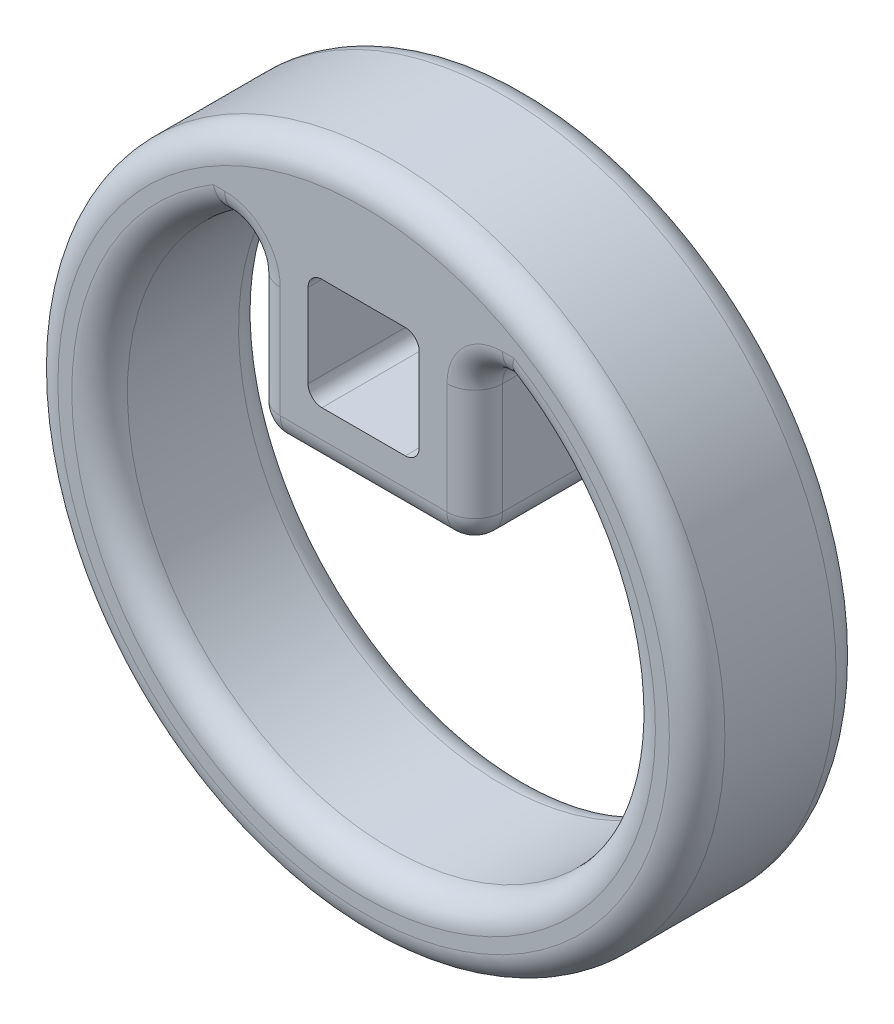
ISO-10303-21;
HEADER;
FILE_DESCRIPTION(('STEP AP214'),'2;1');
FILE_NAME('part.step','',(''),(''),'','','');
FILE_SCHEMA(('AUTOMOTIVE_DESIGN { 1 0 10303 214 1 1 1 1 }'));
ENDSEC;
DATA;
#1=APPLICATION_CONTEXT('core data for automotive mechanical design processes');
#2=APPLICATION_PROTOCOL_DEFINITION('international standard','automotive_design',2000,#1);
#3=PRODUCT_CONTEXT('',#1,'mechanical');
#4=PRODUCT('Part','Part','',(#3));
#5=PRODUCT_RELATED_PRODUCT_CATEGORY('part','',(#4));
#6=PRODUCT_DEFINITION_FORMATION('','',#4);
#7=PRODUCT_DEFINITION_CONTEXT('part definition',#1,'design');
#8=PRODUCT_DEFINITION('design','',#6,#7);
#9=PRODUCT_DEFINITION_SHAPE('','',#8);
#10=(LENGTH_UNIT() NAMED_UNIT(*) SI_UNIT(.MILLI.,.METRE.));
#11=(NAMED_UNIT(*) PLANE_ANGLE_UNIT() SI_UNIT($,.RADIAN.));
#12=(NAMED_UNIT(*) SI_UNIT($,.STERADIAN.) SOLID_ANGLE_UNIT());
#13=UNCERTAINTY_MEASURE_WITH_UNIT(LENGTH_MEASURE(1.E-05),#10,'distance_accuracy_value','');
#14=(GEOMETRIC_REPRESENTATION_CONTEXT(3) GLOBAL_UNCERTAINTY_ASSIGNED_CONTEXT((#13)) GLOBAL_UNIT_ASSIGNED_CONTEXT((#10,
#11,#12)) REPRESENTATION_CONTEXT('',''));
#15=CARTESIAN_POINT('',(0.,0.,0.));
#16=DIRECTION('',(0.,0.,1.));
#17=DIRECTION('',(1.,0.,0.));
#18=AXIS2_PLACEMENT_3D('',#15,#16,#17);
#19=CARTESIAN_POINT('',(0.336140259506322,-12.7325926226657,12.));
#20=DIRECTION('',(0.,0.,1.));
#21=DIRECTION('',(1.,0.,0.));
#22=AXIS2_PLACEMENT_3D('',#19,#20,#21);
#23=PLANE('',#22);
#24=CARTESIAN_POINT('',(0.336140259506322,-12.7325926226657,12.));
#25=DIRECTION('',(0.,0.,1.));
#26=DIRECTION('',(1.,0.,0.));
#27=AXIS2_PLACEMENT_3D('',#24,#25,#26);
#28=CIRCLE('',#27,22.);
#29=CARTESIAN_POINT('',(22.3361402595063,-12.7325926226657,12.));
#30=VERTEX_POINT('',#29);
#31=EDGE_CURVE('E328',#30,#30,#28,.T.);
#32=ORIENTED_EDGE('',*,*,#31,.T.);
#33=EDGE_LOOP('',(#32));
#34=FACE_BOUND('',#33,.T.);
#35=DIRECTION('',(1.,0.,0.));
#36=VECTOR('',#35,1.);
#37=CARTESIAN_POINT('',(-2.66385974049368,-4.73259262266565,12.));
#38=LINE('',#37,#36);
#39=CARTESIAN_POINT('',(-2.66385974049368,-4.73259262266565,12.));
#40=VERTEX_POINT('',#39);
#41=CARTESIAN_POINT('',(3.33614025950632,-4.73259262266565,12.));
#42=VERTEX_POINT('',#41);
#43=EDGE_CURVE('E229',#40,#42,#38,.T.);
#44=ORIENTED_EDGE('',*,*,#43,.F.);
#45=CARTESIAN_POINT('',(-2.66385974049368,-3.73259262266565,12.));
#46=DIRECTION('',(0.,0.,1.));
#47=DIRECTION('',(1.,0.,0.));
#48=AXIS2_PLACEMENT_3D('',#45,#46,#47);
#49=CIRCLE('',#48,1.);
#50=CARTESIAN_POINT('',(-3.66385974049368,-3.73259262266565,12.));
#51=VERTEX_POINT('',#50);
#52=EDGE_CURVE('E218',#51,#40,#49,.T.);
#53=ORIENTED_EDGE('',*,*,#52,.F.);
#54=DIRECTION('',(0.,-1.,0.));
#55=VECTOR('',#54,1.);
#56=CARTESIAN_POINT('',(-3.66385974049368,2.26740737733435,12.));
#57=LINE('',#56,#55);
#58=CARTESIAN_POINT('',(-3.66385974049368,2.26740737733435,12.));
#59=VERTEX_POINT('',#58);
#60=EDGE_CURVE('E264',#59,#51,#57,.T.);
#61=ORIENTED_EDGE('',*,*,#60,.F.);
#62=CARTESIAN_POINT('',(-2.66385974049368,2.26740737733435,12.));
#63=DIRECTION('',(0.,0.,1.));
#64=DIRECTION('',(1.,0.,0.));
#65=AXIS2_PLACEMENT_3D('',#62,#63,#64);
#66=CIRCLE('',#65,1.);
#67=CARTESIAN_POINT('',(-2.66385974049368,3.26740737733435,12.));
#68=VERTEX_POINT('',#67);
#69=EDGE_CURVE('E260',#68,#59,#66,.T.);
#70=ORIENTED_EDGE('',*,*,#69,.F.);
#71=DIRECTION('',(-1.,0.,0.));
#72=VECTOR('',#71,1.);
#73=CARTESIAN_POINT('',(-2.66385974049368,3.26740737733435,12.));
#74=LINE('',#73,#72);
#75=CARTESIAN_POINT('',(3.33614025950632,3.26740737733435,12.));
#76=VERTEX_POINT('',#75);
#77=EDGE_CURVE('E257',#76,#68,#74,.T.);
#78=ORIENTED_EDGE('',*,*,#77,.F.);
#79=CARTESIAN_POINT('',(3.33614025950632,2.26740737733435,12.));
#80=DIRECTION('',(0.,0.,1.));
#81=DIRECTION('',(-1.,0.,0.));
#82=AXIS2_PLACEMENT_3D('',#79,#80,#81);
#83=CIRCLE('',#82,1.);
#84=CARTESIAN_POINT('',(4.33614025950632,2.26740737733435,12.));
#85=VERTEX_POINT('',#84);
#86=EDGE_CURVE('E254',#85,#76,#83,.T.);
#87=ORIENTED_EDGE('',*,*,#86,.F.);
#88=DIRECTION('',(0.,1.,0.));
#89=VECTOR('',#88,1.);
#90=CARTESIAN_POINT('',(4.33614025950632,2.26740737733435,12.));
#91=LINE('',#90,#89);
#92=CARTESIAN_POINT('',(4.33614025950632,-3.73259262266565,12.));
#93=VERTEX_POINT('',#92);
#94=EDGE_CURVE('E248',#93,#85,#91,.T.);
#95=ORIENTED_EDGE('',*,*,#94,.F.);
#96=CARTESIAN_POINT('',(3.33614025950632,-3.73259262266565,12.));
#97=DIRECTION('',(0.,0.,1.));
#98=DIRECTION('',(1.,0.,0.));
#99=AXIS2_PLACEMENT_3D('',#96,#97,#98);
#100=CIRCLE('',#99,1.);
#101=EDGE_CURVE('E244',#42,#93,#100,.T.);
#102=ORIENTED_EDGE('',*,*,#101,.F.);
#103=EDGE_LOOP('',(#44,#53,#61,#70,#78,#87,#95,#102));
#104=FACE_BOUND('',#103,.T.);
#105=DIRECTION('',(-1.,0.,0.));
#106=VECTOR('',#105,1.);
#107=CARTESIAN_POINT('',(0.336140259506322,5.26740737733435,12.));
#108=LINE('',#107,#106);
#109=CARTESIAN_POINT('',(10.3361402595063,5.26740737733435,12.));
#110=VERTEX_POINT('',#109);
#111=CARTESIAN_POINT('',(11.1527940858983,5.26740737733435,12.));
#112=VERTEX_POINT('',#111);
#113=EDGE_CURVE('E368',#110,#112,#108,.F.);
#114=ORIENTED_EDGE('',*,*,#113,.T.);
#115=CARTESIAN_POINT('',(0.336140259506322,-12.7325926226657,12.));
#116=DIRECTION('',(0.,0.,1.));
#117=DIRECTION('',(1.,0.,0.));
#118=AXIS2_PLACEMENT_3D('',#115,#116,#117);
#119=CIRCLE('',#118,21.);
#120=CARTESIAN_POINT('',(-10.4805135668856,5.26740737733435,12.));
#121=VERTEX_POINT('',#120);
#122=EDGE_CURVE('E332',#112,#121,#119,.F.);
#123=ORIENTED_EDGE('',*,*,#122,.T.);
#124=DIRECTION('',(-1.,0.,0.));
#125=VECTOR('',#124,1.);
#126=CARTESIAN_POINT('',(0.336140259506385,5.26740737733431,12.));
#127=LINE('',#126,#125);
#128=CARTESIAN_POINT('',(-9.66385974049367,5.26740737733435,12.));
#129=VERTEX_POINT('',#128);
#130=EDGE_CURVE('E359',#121,#129,#127,.F.);
#131=ORIENTED_EDGE('',*,*,#130,.T.);
#132=CARTESIAN_POINT('',(-9.66385974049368,1.26740737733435,12.));
#133=DIRECTION('',(0.,0.,1.));
#134=DIRECTION('',(1.,0.,0.));
#135=AXIS2_PLACEMENT_3D('',#132,#133,#134);
#136=CIRCLE('',#135,4.);
#137=CARTESIAN_POINT('',(-5.66385974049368,1.26740737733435,12.));
#138=VERTEX_POINT('',#137);
#139=EDGE_CURVE('E356',#129,#138,#136,.F.);
#140=ORIENTED_EDGE('',*,*,#139,.T.);
#141=DIRECTION('',(0.,1.,0.));
#142=VECTOR('',#141,1.);
#143=CARTESIAN_POINT('',(-5.66385974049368,-12.7325926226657,12.));
#144=LINE('',#143,#142);
#145=CARTESIAN_POINT('',(-5.66385974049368,-6.73259262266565,12.));
#146=VERTEX_POINT('',#145);
#147=EDGE_CURVE('E353',#138,#146,#144,.F.);
#148=ORIENTED_EDGE('',*,*,#147,.T.);
#149=DIRECTION('',(-1.,0.,0.));
#150=VECTOR('',#149,1.);
#151=CARTESIAN_POINT('',(0.336140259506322,-6.73259262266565,12.));
#152=LINE('',#151,#150);
#153=CARTESIAN_POINT('',(6.33614025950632,-6.73259262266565,12.));
#154=VERTEX_POINT('',#153);
#155=EDGE_CURVE('E350',#146,#154,#152,.F.);
#156=ORIENTED_EDGE('',*,*,#155,.T.);
#157=DIRECTION('',(0.,-1.,0.));
#158=VECTOR('',#157,1.);
#159=CARTESIAN_POINT('',(6.33614025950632,-12.7325926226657,12.));
#160=LINE('',#159,#158);
#161=CARTESIAN_POINT('',(6.33614025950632,1.26740737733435,12.));
#162=VERTEX_POINT('',#161);
#163=EDGE_CURVE('E362',#154,#162,#160,.F.);
#164=ORIENTED_EDGE('',*,*,#163,.T.);
#165=CARTESIAN_POINT('',(10.3361402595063,1.26740737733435,12.));
#166=DIRECTION('',(0.,0.,1.));
#167=DIRECTION('',(1.,0.,0.));
#168=AXIS2_PLACEMENT_3D('',#165,#166,#167);
#169=CIRCLE('',#168,4.);
#170=EDGE_CURVE('E365',#162,#110,#169,.F.);
#171=ORIENTED_EDGE('',*,*,#170,.T.);
#172=EDGE_LOOP('',(#114,#123,#131,#140,#148,#156,#164,#171));
#173=FACE_BOUND('',#172,.T.);
#174=ADVANCED_FACE('F41',(#34,#104,#173),#23,.T.);
#175=CARTESIAN_POINT('',(0.336140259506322,-12.7325926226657,0.));
#176=DIRECTION('',(0.,0.,1.));
#177=DIRECTION('',(1.,0.,0.));
#178=AXIS2_PLACEMENT_3D('',#175,#176,#177);
#179=PLANE('',#178);
#180=CARTESIAN_POINT('',(0.336140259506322,-12.7325926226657,0.));
#181=DIRECTION('',(0.,0.,1.));
#182=DIRECTION('',(1.,0.,0.));
#183=AXIS2_PLACEMENT_3D('',#180,#181,#182);
#184=CIRCLE('',#183,21.);
#185=CARTESIAN_POINT('',(-10.4805135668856,5.26740737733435,0.));
#186=VERTEX_POINT('',#185);
#187=CARTESIAN_POINT('',(11.1527940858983,5.26740737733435,0.));
#188=VERTEX_POINT('',#187);
#189=EDGE_CURVE('E60',#186,#188,#184,.T.);
#190=ORIENTED_EDGE('',*,*,#189,.T.);
#191=DIRECTION('',(-1.,0.,0.));
#192=VECTOR('',#191,1.);
#193=CARTESIAN_POINT('',(10.3361402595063,5.26740737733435,0.));
#194=LINE('',#193,#192);
#195=CARTESIAN_POINT('',(10.3361402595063,5.26740737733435,0.));
#196=VERTEX_POINT('',#195);
#197=EDGE_CURVE('E64',#188,#196,#194,.T.);
#198=ORIENTED_EDGE('',*,*,#197,.T.);
#199=CARTESIAN_POINT('',(10.3361402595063,1.26740737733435,0.));
#200=DIRECTION('',(0.,0.,1.));
#201=DIRECTION('',(1.,0.,0.));
#202=AXIS2_PLACEMENT_3D('',#199,#200,#201);
#203=CIRCLE('',#202,4.);
#204=CARTESIAN_POINT('',(6.33614025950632,1.26740737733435,0.));
#205=VERTEX_POINT('',#204);
#206=EDGE_CURVE('E429',#196,#205,#203,.T.);
#207=ORIENTED_EDGE('',*,*,#206,.T.);
#208=DIRECTION('',(0.,-1.,0.));
#209=VECTOR('',#208,1.);
#210=CARTESIAN_POINT('',(6.33614025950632,-6.73259262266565,0.));
#211=LINE('',#210,#209);
#212=CARTESIAN_POINT('',(6.33614025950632,-6.73259262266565,0.));
#213=VERTEX_POINT('',#212);
#214=EDGE_CURVE('E417',#205,#213,#211,.T.);
#215=ORIENTED_EDGE('',*,*,#214,.T.);
#216=DIRECTION('',(-1.,0.,0.));
#217=VECTOR('',#216,1.);
#218=CARTESIAN_POINT('',(-5.66385974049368,-6.73259262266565,0.));
#219=LINE('',#218,#217);
#220=CARTESIAN_POINT('',(-5.66385974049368,-6.73259262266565,0.));
#221=VERTEX_POINT('',#220);
#222=EDGE_CURVE('E414',#213,#221,#219,.T.);
#223=ORIENTED_EDGE('',*,*,#222,.T.);
#224=DIRECTION('',(0.,1.,0.));
#225=VECTOR('',#224,1.);
#226=CARTESIAN_POINT('',(-5.66385974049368,1.26740737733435,0.));
#227=LINE('',#226,#225);
#228=CARTESIAN_POINT('',(-5.66385974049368,1.26740737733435,0.));
#229=VERTEX_POINT('',#228);
#230=EDGE_CURVE('E420',#221,#229,#227,.T.);
#231=ORIENTED_EDGE('',*,*,#230,.T.);
#232=CARTESIAN_POINT('',(-9.66385974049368,1.26740737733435,0.));
#233=DIRECTION('',(0.,0.,1.));
#234=DIRECTION('',(1.,0.,0.));
#235=AXIS2_PLACEMENT_3D('',#232,#233,#234);
#236=CIRCLE('',#235,4.);
#237=CARTESIAN_POINT('',(-9.66385974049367,5.26740737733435,0.));
#238=VERTEX_POINT('',#237);
#239=EDGE_CURVE('E423',#229,#238,#236,.T.);
#240=ORIENTED_EDGE('',*,*,#239,.T.);
#241=DIRECTION('',(-1.,0.,0.));
#242=VECTOR('',#241,1.);
#243=CARTESIAN_POINT('',(-13.2653302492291,5.26740737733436,0.));
#244=LINE('',#243,#242);
#245=EDGE_CURVE('E426',#238,#186,#244,.T.);
#246=ORIENTED_EDGE('',*,*,#245,.T.);
#247=EDGE_LOOP('',(#190,#198,#207,#215,#223,#231,#240,#246));
#248=FACE_BOUND('',#247,.T.);
#249=CARTESIAN_POINT('',(0.336140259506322,-12.7325926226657,0.));
#250=DIRECTION('',(0.,0.,1.));
#251=DIRECTION('',(1.,0.,0.));
#252=AXIS2_PLACEMENT_3D('',#249,#250,#251);
#253=CIRCLE('',#252,22.);
#254=CARTESIAN_POINT('',(22.3361402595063,-12.7325926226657,0.));
#255=VERTEX_POINT('',#254);
#256=EDGE_CURVE('E238',#255,#255,#253,.F.);
#257=ORIENTED_EDGE('',*,*,#256,.T.);
#258=EDGE_LOOP('',(#257));
#259=FACE_BOUND('',#258,.T.);
#260=CARTESIAN_POINT('',(-2.66385974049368,-3.73259262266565,0.));
#261=DIRECTION('',(0.,0.,1.));
#262=DIRECTION('',(1.,0.,0.));
#263=AXIS2_PLACEMENT_3D('',#260,#261,#262);
#264=CIRCLE('',#263,1.);
#265=CARTESIAN_POINT('',(-3.66385974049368,-3.73259262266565,0.));
#266=VERTEX_POINT('',#265);
#267=CARTESIAN_POINT('',(-2.66385974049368,-4.73259262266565,0.));
#268=VERTEX_POINT('',#267);
#269=EDGE_CURVE('E267',#266,#268,#264,.T.);
#270=ORIENTED_EDGE('',*,*,#269,.T.);
#271=DIRECTION('',(1.,0.,0.));
#272=VECTOR('',#271,1.);
#273=CARTESIAN_POINT('',(-2.66385974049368,-4.73259262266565,0.));
#274=LINE('',#273,#272);
#275=CARTESIAN_POINT('',(3.33614025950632,-4.73259262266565,0.));
#276=VERTEX_POINT('',#275);
#277=EDGE_CURVE('E236',#268,#276,#274,.T.);
#278=ORIENTED_EDGE('',*,*,#277,.T.);
#279=CARTESIAN_POINT('',(3.33614025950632,-3.73259262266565,0.));
#280=DIRECTION('',(0.,0.,1.));
#281=DIRECTION('',(1.,0.,0.));
#282=AXIS2_PLACEMENT_3D('',#279,#280,#281);
#283=CIRCLE('',#282,1.);
#284=CARTESIAN_POINT('',(4.33614025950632,-3.73259262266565,0.));
#285=VERTEX_POINT('',#284);
#286=EDGE_CURVE('E273',#276,#285,#283,.T.);
#287=ORIENTED_EDGE('',*,*,#286,.T.);
#288=DIRECTION('',(0.,1.,0.));
#289=VECTOR('',#288,1.);
#290=CARTESIAN_POINT('',(4.33614025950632,2.26740737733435,0.));
#291=LINE('',#290,#289);
#292=CARTESIAN_POINT('',(4.33614025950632,2.26740737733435,0.));
#293=VERTEX_POINT('',#292);
#294=EDGE_CURVE('E277',#285,#293,#291,.T.);
#295=ORIENTED_EDGE('',*,*,#294,.T.);
#296=CARTESIAN_POINT('',(3.33614025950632,2.26740737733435,0.));
#297=DIRECTION('',(0.,0.,1.));
#298=DIRECTION('',(-1.,0.,0.));
#299=AXIS2_PLACEMENT_3D('',#296,#297,#298);
#300=CIRCLE('',#299,1.);
#301=CARTESIAN_POINT('',(3.33614025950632,3.26740737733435,0.));
#302=VERTEX_POINT('',#301);
#303=EDGE_CURVE('E281',#293,#302,#300,.T.);
#304=ORIENTED_EDGE('',*,*,#303,.T.);
#305=DIRECTION('',(-1.,0.,0.));
#306=VECTOR('',#305,1.);
#307=CARTESIAN_POINT('',(-2.66385974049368,3.26740737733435,0.));
#308=LINE('',#307,#306);
#309=CARTESIAN_POINT('',(-2.66385974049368,3.26740737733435,0.));
#310=VERTEX_POINT('',#309);
#311=EDGE_CURVE('E285',#302,#310,#308,.T.);
#312=ORIENTED_EDGE('',*,*,#311,.T.);
#313=CARTESIAN_POINT('',(-2.66385974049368,2.26740737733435,0.));
#314=DIRECTION('',(0.,0.,1.));
#315=DIRECTION('',(1.,0.,0.));
#316=AXIS2_PLACEMENT_3D('',#313,#314,#315);
#317=CIRCLE('',#316,1.);
#318=CARTESIAN_POINT('',(-3.66385974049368,2.26740737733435,0.));
#319=VERTEX_POINT('',#318);
#320=EDGE_CURVE('E289',#310,#319,#317,.T.);
#321=ORIENTED_EDGE('',*,*,#320,.T.);
#322=DIRECTION('',(0.,-1.,0.));
#323=VECTOR('',#322,1.);
#324=CARTESIAN_POINT('',(-3.66385974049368,2.26740737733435,0.));
#325=LINE('',#324,#323);
#326=EDGE_CURVE('E230',#319,#266,#325,.T.);
#327=ORIENTED_EDGE('',*,*,#326,.T.);
#328=EDGE_LOOP('',(#270,#278,#287,#295,#304,#312,#321,#327));
#329=FACE_BOUND('',#328,.T.);
#330=ADVANCED_FACE('F535',(#248,#259,#329),#179,.F.);
#331=CARTESIAN_POINT('',(0.336140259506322,-12.7325926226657,12.));
#332=DIRECTION('',(0.,0.,-1.));
#333=DIRECTION('',(-1.,0.,0.));
#334=AXIS2_PLACEMENT_3D('',#331,#332,#333);
#335=CYLINDRICAL_SURFACE('',#334,24.);
#336=CARTESIAN_POINT('',(0.336140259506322,-12.7325926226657,10.));
#337=DIRECTION('',(0.,0.,1.));
#338=DIRECTION('',(1.,0.,0.));
#339=AXIS2_PLACEMENT_3D('',#336,#337,#338);
#340=CIRCLE('',#339,24.);
#341=CARTESIAN_POINT('',(24.3361402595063,-12.7325926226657,10.));
#342=VERTEX_POINT('',#341);
#343=EDGE_CURVE('E339',#342,#342,#340,.F.);
#344=ORIENTED_EDGE('',*,*,#343,.T.);
#345=EDGE_LOOP('',(#344));
#346=FACE_BOUND('',#345,.T.);
#347=CARTESIAN_POINT('',(0.336140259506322,-12.7325926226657,2.));
#348=DIRECTION('',(0.,0.,1.));
#349=DIRECTION('',(1.,0.,0.));
#350=AXIS2_PLACEMENT_3D('',#347,#348,#349);
#351=CIRCLE('',#350,24.);
#352=CARTESIAN_POINT('',(24.3361402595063,-12.7325926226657,2.));
#353=VERTEX_POINT('',#352);
#354=EDGE_CURVE('E335',#353,#353,#351,.T.);
#355=ORIENTED_EDGE('',*,*,#354,.T.);
#356=EDGE_LOOP('',(#355));
#357=FACE_BOUND('',#356,.T.);
#358=ADVANCED_FACE('F531',(#346,#357),#335,.T.);
#359=CARTESIAN_POINT('',(-2.66385974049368,-3.73259262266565,12.));
#360=DIRECTION('',(0.,0.,-1.));
#361=DIRECTION('',(-1.,0.,0.));
#362=AXIS2_PLACEMENT_3D('',#359,#360,#361);
#363=CYLINDRICAL_SURFACE('',#362,1.);
#364=ORIENTED_EDGE('',*,*,#269,.F.);
#365=DIRECTION('',(0.,0.,-1.));
#366=VECTOR('',#365,1.);
#367=CARTESIAN_POINT('',(-3.66385974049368,-3.73259262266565,12.));
#368=LINE('',#367,#366);
#369=EDGE_CURVE('E224',#51,#266,#368,.T.);
#370=ORIENTED_EDGE('',*,*,#369,.F.);
#371=ORIENTED_EDGE('',*,*,#52,.T.);
#372=DIRECTION('',(0.,0.,-1.));
#373=VECTOR('',#372,1.);
#374=CARTESIAN_POINT('',(-2.66385974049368,-4.73259262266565,12.));
#375=LINE('',#374,#373);
#376=EDGE_CURVE('E221',#40,#268,#375,.T.);
#377=ORIENTED_EDGE('',*,*,#376,.T.);
#378=EDGE_LOOP('',(#364,#370,#371,#377));
#379=FACE_BOUND('',#378,.T.);
#380=ADVANCED_FACE('F220',(#379),#363,.F.);
#381=CARTESIAN_POINT('',(-2.66385974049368,-4.73259262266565,12.));
#382=DIRECTION('',(0.,1.,0.));
#383=DIRECTION('',(-1.,0.,0.));
#384=AXIS2_PLACEMENT_3D('',#381,#382,#383);
#385=PLANE('',#384);
#386=ORIENTED_EDGE('',*,*,#277,.F.);
#387=ORIENTED_EDGE('',*,*,#376,.F.);
#388=ORIENTED_EDGE('',*,*,#43,.T.);
#389=DIRECTION('',(0.,0.,-1.));
#390=VECTOR('',#389,1.);
#391=CARTESIAN_POINT('',(3.33614025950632,-4.73259262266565,12.));
#392=LINE('',#391,#390);
#393=EDGE_CURVE('E239',#42,#276,#392,.T.);
#394=ORIENTED_EDGE('',*,*,#393,.T.);
#395=EDGE_LOOP('',(#386,#387,#388,#394));
#396=FACE_BOUND('',#395,.T.);
#397=ADVANCED_FACE('F233',(#396),#385,.T.);
#398=CARTESIAN_POINT('',(3.33614025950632,-3.73259262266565,12.));
#399=DIRECTION('',(0.,0.,-1.));
#400=DIRECTION('',(-1.,0.,0.));
#401=AXIS2_PLACEMENT_3D('',#398,#399,#400);
#402=CYLINDRICAL_SURFACE('',#401,1.);
#403=ORIENTED_EDGE('',*,*,#286,.F.);
#404=ORIENTED_EDGE('',*,*,#393,.F.);
#405=ORIENTED_EDGE('',*,*,#101,.T.);
#406=DIRECTION('',(0.,0.,-1.));
#407=VECTOR('',#406,1.);
#408=CARTESIAN_POINT('',(4.33614025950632,-3.73259262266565,12.));
#409=LINE('',#408,#407);
#410=EDGE_CURVE('E310',#93,#285,#409,.T.);
#411=ORIENTED_EDGE('',*,*,#410,.T.);
#412=EDGE_LOOP('',(#403,#404,#405,#411));
#413=FACE_BOUND('',#412,.T.);
#414=ADVANCED_FACE('F546',(#413),#402,.F.);
#415=CARTESIAN_POINT('',(4.33614025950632,2.26740737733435,12.));
#416=DIRECTION('',(-1.,0.,0.));
#417=DIRECTION('',(0.,0.,1.));
#418=AXIS2_PLACEMENT_3D('',#415,#416,#417);
#419=PLANE('',#418);
#420=ORIENTED_EDGE('',*,*,#294,.F.);
#421=ORIENTED_EDGE('',*,*,#410,.F.);
#422=ORIENTED_EDGE('',*,*,#94,.T.);
#423=DIRECTION('',(0.,0.,-1.));
#424=VECTOR('',#423,1.);
#425=CARTESIAN_POINT('',(4.33614025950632,2.26740737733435,12.));
#426=LINE('',#425,#424);
#427=EDGE_CURVE('E307',#85,#293,#426,.T.);
#428=ORIENTED_EDGE('',*,*,#427,.T.);
#429=EDGE_LOOP('',(#420,#421,#422,#428));
#430=FACE_BOUND('',#429,.T.);
#431=ADVANCED_FACE('F549',(#430),#419,.T.);
#432=CARTESIAN_POINT('',(3.33614025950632,2.26740737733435,12.));
#433=DIRECTION('',(0.,0.,-1.));
#434=DIRECTION('',(-1.,0.,0.));
#435=AXIS2_PLACEMENT_3D('',#432,#433,#434);
#436=CYLINDRICAL_SURFACE('',#435,1.);
#437=ORIENTED_EDGE('',*,*,#303,.F.);
#438=ORIENTED_EDGE('',*,*,#427,.F.);
#439=ORIENTED_EDGE('',*,*,#86,.T.);
#440=DIRECTION('',(0.,0.,-1.));
#441=VECTOR('',#440,1.);
#442=CARTESIAN_POINT('',(3.33614025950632,3.26740737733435,12.));
#443=LINE('',#442,#441);
#444=EDGE_CURVE('E304',#76,#302,#443,.T.);
#445=ORIENTED_EDGE('',*,*,#444,.T.);
#446=EDGE_LOOP('',(#437,#438,#439,#445));
#447=FACE_BOUND('',#446,.T.);
#448=ADVANCED_FACE('F553',(#447),#436,.F.);
#449=CARTESIAN_POINT('',(-2.66385974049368,3.26740737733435,12.));
#450=DIRECTION('',(0.,-1.,0.));
#451=DIRECTION('',(1.,0.,0.));
#452=AXIS2_PLACEMENT_3D('',#449,#450,#451);
#453=PLANE('',#452);
#454=ORIENTED_EDGE('',*,*,#311,.F.);
#455=ORIENTED_EDGE('',*,*,#444,.F.);
#456=ORIENTED_EDGE('',*,*,#77,.T.);
#457=DIRECTION('',(0.,0.,-1.));
#458=VECTOR('',#457,1.);
#459=CARTESIAN_POINT('',(-2.66385974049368,3.26740737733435,12.));
#460=LINE('',#459,#458);
#461=EDGE_CURVE('E301',#68,#310,#460,.T.);
#462=ORIENTED_EDGE('',*,*,#461,.T.);
#463=EDGE_LOOP('',(#454,#455,#456,#462));
#464=FACE_BOUND('',#463,.T.);
#465=ADVANCED_FACE('F557',(#464),#453,.T.);
#466=CARTESIAN_POINT('',(-2.66385974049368,2.26740737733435,12.));
#467=DIRECTION('',(0.,0.,-1.));
#468=DIRECTION('',(-1.,0.,0.));
#469=AXIS2_PLACEMENT_3D('',#466,#467,#468);
#470=CYLINDRICAL_SURFACE('',#469,1.);
#471=ORIENTED_EDGE('',*,*,#320,.F.);
#472=ORIENTED_EDGE('',*,*,#461,.F.);
#473=ORIENTED_EDGE('',*,*,#69,.T.);
#474=DIRECTION('',(0.,0.,-1.));
#475=VECTOR('',#474,1.);
#476=CARTESIAN_POINT('',(-3.66385974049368,2.26740737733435,12.));
#477=LINE('',#476,#475);
#478=EDGE_CURVE('E298',#59,#319,#477,.T.);
#479=ORIENTED_EDGE('',*,*,#478,.T.);
#480=EDGE_LOOP('',(#471,#472,#473,#479));
#481=FACE_BOUND('',#480,.T.);
#482=ADVANCED_FACE('F561',(#481),#470,.F.);
#483=CARTESIAN_POINT('',(-3.66385974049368,2.26740737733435,12.));
#484=DIRECTION('',(1.,0.,0.));
#485=DIRECTION('',(0.,1.,0.));
#486=AXIS2_PLACEMENT_3D('',#483,#484,#485);
#487=PLANE('',#486);
#488=ORIENTED_EDGE('',*,*,#326,.F.);
#489=ORIENTED_EDGE('',*,*,#478,.F.);
#490=ORIENTED_EDGE('',*,*,#60,.T.);
#491=ORIENTED_EDGE('',*,*,#369,.T.);
#492=EDGE_LOOP('',(#488,#489,#490,#491));
#493=FACE_BOUND('',#492,.T.);
#494=ADVANCED_FACE('F565',(#493),#487,.T.);
#495=CARTESIAN_POINT('',(6.33614025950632,-6.73259262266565,12.));
#496=DIRECTION('',(0.,0.,-1.));
#497=DIRECTION('',(-1.,0.,0.));
#498=AXIS2_PLACEMENT_3D('',#495,#496,#497);
#499=CYLINDRICAL_SURFACE('',#498,2.);
#500=DIRECTION('',(0.,0.,-1.));
#501=VECTOR('',#500,1.);
#502=CARTESIAN_POINT('',(8.33614025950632,-6.73259262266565,12.));
#503=LINE('',#502,#501);
#504=CARTESIAN_POINT('',(8.33614025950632,-6.73259262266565,10.));
#505=VERTEX_POINT('',#504);
#506=CARTESIAN_POINT('',(8.33614025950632,-6.73259262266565,2.));
#507=VERTEX_POINT('',#506);
#508=EDGE_CURVE('E620',#505,#507,#503,.T.);
#509=ORIENTED_EDGE('',*,*,#508,.F.);
#510=CARTESIAN_POINT('',(6.33614025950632,-6.73259262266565,10.));
#511=DIRECTION('',(0.,0.,-1.));
#512=DIRECTION('',(-1.,0.,0.));
#513=AXIS2_PLACEMENT_3D('',#510,#511,#512);
#514=CIRCLE('',#513,2.);
#515=CARTESIAN_POINT('',(6.33614025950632,-8.73259262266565,10.));
#516=VERTEX_POINT('',#515);
#517=EDGE_CURVE('E387',#505,#516,#514,.T.);
#518=ORIENTED_EDGE('',*,*,#517,.T.);
#519=DIRECTION('',(0.,0.,-1.));
#520=VECTOR('',#519,1.);
#521=CARTESIAN_POINT('',(6.33614025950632,-8.73259262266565,12.));
#522=LINE('',#521,#520);
#523=CARTESIAN_POINT('',(6.33614025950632,-8.73259262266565,2.));
#524=VERTEX_POINT('',#523);
#525=EDGE_CURVE('E270',#516,#524,#522,.T.);
#526=ORIENTED_EDGE('',*,*,#525,.T.);
#527=CARTESIAN_POINT('',(6.33614025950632,-6.73259262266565,2.));
#528=DIRECTION('',(0.,0.,-1.));
#529=DIRECTION('',(-1.,0.,0.));
#530=AXIS2_PLACEMENT_3D('',#527,#528,#529);
#531=CIRCLE('',#530,2.);
#532=EDGE_CURVE('E384',#524,#507,#531,.F.);
#533=ORIENTED_EDGE('',*,*,#532,.T.);
#534=EDGE_LOOP('',(#509,#518,#526,#533));
#535=FACE_BOUND('',#534,.T.);
#536=ADVANCED_FACE('F569',(#535),#499,.T.);
#537=CARTESIAN_POINT('',(-5.66385974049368,-8.73259262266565,12.));
#538=DIRECTION('',(0.,-1.,0.));
#539=DIRECTION('',(0.,0.,-1.));
#540=AXIS2_PLACEMENT_3D('',#537,#538,#539);
#541=PLANE('',#540);
#542=ORIENTED_EDGE('',*,*,#525,.F.);
#543=DIRECTION('',(-1.,0.,0.));
#544=VECTOR('',#543,1.);
#545=CARTESIAN_POINT('',(-5.66385974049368,-8.73259262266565,10.));
#546=LINE('',#545,#544);
#547=CARTESIAN_POINT('',(-5.66385974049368,-8.73259262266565,10.));
#548=VERTEX_POINT('',#547);
#549=EDGE_CURVE('E437',#516,#548,#546,.T.);
#550=ORIENTED_EDGE('',*,*,#549,.T.);
#551=DIRECTION('',(0.,0.,-1.));
#552=VECTOR('',#551,1.);
#553=CARTESIAN_POINT('',(-5.66385974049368,-8.73259262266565,12.));
#554=LINE('',#553,#552);
#555=CARTESIAN_POINT('',(-5.66385974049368,-8.73259262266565,2.));
#556=VERTEX_POINT('',#555);
#557=EDGE_CURVE('E715',#548,#556,#554,.T.);
#558=ORIENTED_EDGE('',*,*,#557,.T.);
#559=DIRECTION('',(-1.,0.,0.));
#560=VECTOR('',#559,1.);
#561=CARTESIAN_POINT('',(6.33614025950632,-8.73259262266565,2.));
#562=LINE('',#561,#560);
#563=EDGE_CURVE('E434',#556,#524,#562,.F.);
#564=ORIENTED_EDGE('',*,*,#563,.T.);
#565=EDGE_LOOP('',(#542,#550,#558,#564));
#566=FACE_BOUND('',#565,.T.);
#567=ADVANCED_FACE('F573',(#566),#541,.T.);
#568=CARTESIAN_POINT('',(-5.66385974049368,-6.73259262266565,12.));
#569=DIRECTION('',(0.,0.,-1.));
#570=DIRECTION('',(-1.,0.,0.));
#571=AXIS2_PLACEMENT_3D('',#568,#569,#570);
#572=CYLINDRICAL_SURFACE('',#571,2.);
#573=ORIENTED_EDGE('',*,*,#557,.F.);
#574=CARTESIAN_POINT('',(-5.66385974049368,-6.73259262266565,10.));
#575=DIRECTION('',(0.,0.,-1.));
#576=DIRECTION('',(-1.,0.,0.));
#577=AXIS2_PLACEMENT_3D('',#574,#575,#576);
#578=CIRCLE('',#577,2.);
#579=CARTESIAN_POINT('',(-7.66385974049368,-6.73259262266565,10.));
#580=VERTEX_POINT('',#579);
#581=EDGE_CURVE('E411',#548,#580,#578,.T.);
#582=ORIENTED_EDGE('',*,*,#581,.T.);
#583=DIRECTION('',(0.,0.,-1.));
#584=VECTOR('',#583,1.);
#585=CARTESIAN_POINT('',(-7.66385974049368,-6.73259262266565,12.));
#586=LINE('',#585,#584);
#587=CARTESIAN_POINT('',(-7.66385974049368,-6.73259262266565,2.));
#588=VERTEX_POINT('',#587);
#589=EDGE_CURVE('E719',#580,#588,#586,.T.);
#590=ORIENTED_EDGE('',*,*,#589,.T.);
#591=CARTESIAN_POINT('',(-5.66385974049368,-6.73259262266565,2.));
#592=DIRECTION('',(0.,0.,-1.));
#593=DIRECTION('',(-1.,0.,0.));
#594=AXIS2_PLACEMENT_3D('',#591,#592,#593);
#595=CIRCLE('',#594,2.);
#596=EDGE_CURVE('E408',#588,#556,#595,.F.);
#597=ORIENTED_EDGE('',*,*,#596,.T.);
#598=EDGE_LOOP('',(#573,#582,#590,#597));
#599=FACE_BOUND('',#598,.T.);
#600=ADVANCED_FACE('F577',(#599),#572,.T.);
#601=CARTESIAN_POINT('',(-7.66385974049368,1.26740737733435,12.));
#602=DIRECTION('',(-1.,0.,0.));
#603=DIRECTION('',(0.,-1.,0.));
#604=AXIS2_PLACEMENT_3D('',#601,#602,#603);
#605=PLANE('',#604);
#606=ORIENTED_EDGE('',*,*,#589,.F.);
#607=DIRECTION('',(0.,1.,0.));
#608=VECTOR('',#607,1.);
#609=CARTESIAN_POINT('',(-7.66385974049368,1.26740737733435,10.));
#610=LINE('',#609,#608);
#611=CARTESIAN_POINT('',(-7.66385974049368,1.26740737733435,10.));
#612=VERTEX_POINT('',#611);
#613=EDGE_CURVE('E405',#580,#612,#610,.T.);
#614=ORIENTED_EDGE('',*,*,#613,.T.);
#615=DIRECTION('',(0.,0.,-1.));
#616=VECTOR('',#615,1.);
#617=CARTESIAN_POINT('',(-7.66385974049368,1.26740737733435,12.));
#618=LINE('',#617,#616);
#619=CARTESIAN_POINT('',(-7.66385974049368,1.26740737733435,2.));
#620=VERTEX_POINT('',#619);
#621=EDGE_CURVE('E725',#612,#620,#618,.T.);
#622=ORIENTED_EDGE('',*,*,#621,.T.);
#623=DIRECTION('',(0.,1.,0.));
#624=VECTOR('',#623,1.);
#625=CARTESIAN_POINT('',(-7.66385974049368,-6.73259262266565,2.));
#626=LINE('',#625,#624);
#627=EDGE_CURVE('E402',#620,#588,#626,.F.);
#628=ORIENTED_EDGE('',*,*,#627,.T.);
#629=EDGE_LOOP('',(#606,#614,#622,#628));
#630=FACE_BOUND('',#629,.T.);
#631=ADVANCED_FACE('F581',(#630),#605,.T.);
#632=CARTESIAN_POINT('',(-9.66385974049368,1.26740737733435,12.));
#633=DIRECTION('',(0.,0.,-1.));
#634=DIRECTION('',(-1.,0.,0.));
#635=AXIS2_PLACEMENT_3D('',#632,#633,#634);
#636=CYLINDRICAL_SURFACE('',#635,2.);
#637=ORIENTED_EDGE('',*,*,#621,.F.);
#638=CARTESIAN_POINT('',(-9.66385974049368,1.26740737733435,10.));
#639=DIRECTION('',(0.,0.,1.));
#640=DIRECTION('',(1.,0.,0.));
#641=AXIS2_PLACEMENT_3D('',#638,#639,#640);
#642=CIRCLE('',#641,2.);
#643=CARTESIAN_POINT('',(-9.66385974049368,3.26740737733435,10.));
#644=VERTEX_POINT('',#643);
#645=EDGE_CURVE('E399',#612,#644,#642,.T.);
#646=ORIENTED_EDGE('',*,*,#645,.T.);
#647=DIRECTION('',(0.,0.,-1.));
#648=VECTOR('',#647,1.);
#649=CARTESIAN_POINT('',(-9.66385974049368,3.26740737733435,12.));
#650=LINE('',#649,#648);
#651=CARTESIAN_POINT('',(-9.66385974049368,3.26740737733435,2.));
#652=VERTEX_POINT('',#651);
#653=EDGE_CURVE('E729',#644,#652,#650,.T.);
#654=ORIENTED_EDGE('',*,*,#653,.T.);
#655=CARTESIAN_POINT('',(-9.66385974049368,1.26740737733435,2.));
#656=DIRECTION('',(0.,0.,1.));
#657=DIRECTION('',(1.,0.,0.));
#658=AXIS2_PLACEMENT_3D('',#655,#656,#657);
#659=CIRCLE('',#658,2.);
#660=EDGE_CURVE('E396',#652,#620,#659,.F.);
#661=ORIENTED_EDGE('',*,*,#660,.T.);
#662=EDGE_LOOP('',(#637,#646,#654,#661));
#663=FACE_BOUND('',#662,.T.);
#664=ADVANCED_FACE('F585',(#663),#636,.F.);
#665=CARTESIAN_POINT('',(-9.66385974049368,3.26740737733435,12.));
#666=DIRECTION('',(0.,-1.,0.));
#667=DIRECTION('',(1.,0.,0.));
#668=AXIS2_PLACEMENT_3D('',#665,#666,#667);
#669=PLANE('',#668);
#670=ORIENTED_EDGE('',*,*,#653,.F.);
#671=DIRECTION('',(-1.,0.,0.));
#672=VECTOR('',#671,1.);
#673=CARTESIAN_POINT('',(-9.66385974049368,3.26740737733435,10.));
#674=LINE('',#673,#672);
#675=CARTESIAN_POINT('',(-9.91081050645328,3.26740737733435,10.));
#676=VERTEX_POINT('',#675);
#677=EDGE_CURVE('E393',#644,#676,#674,.T.);
#678=ORIENTED_EDGE('',*,*,#677,.T.);
#679=DIRECTION('',(0.,0.,-1.));
#680=VECTOR('',#679,1.);
#681=CARTESIAN_POINT('',(-9.91081050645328,3.26740737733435,12.));
#682=LINE('',#681,#680);
#683=CARTESIAN_POINT('',(-9.91081050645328,3.26740737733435,2.));
#684=VERTEX_POINT('',#683);
#685=EDGE_CURVE('E733',#676,#684,#682,.T.);
#686=ORIENTED_EDGE('',*,*,#685,.T.);
#687=DIRECTION('',(-1.,0.,0.));
#688=VECTOR('',#687,1.);
#689=CARTESIAN_POINT('',(-9.66385974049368,3.26740737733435,2.));
#690=LINE('',#689,#688);
#691=EDGE_CURVE('E390',#684,#652,#690,.F.);
#692=ORIENTED_EDGE('',*,*,#691,.T.);
#693=EDGE_LOOP('',(#670,#678,#686,#692));
#694=FACE_BOUND('',#693,.T.);
#695=ADVANCED_FACE('F589',(#694),#669,.T.);
#696=CARTESIAN_POINT('',(0.336140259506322,-12.7325926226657,12.));
#697=DIRECTION('',(0.,0.,-1.));
#698=DIRECTION('',(-1.,0.,0.));
#699=AXIS2_PLACEMENT_3D('',#696,#697,#698);
#700=CYLINDRICAL_SURFACE('',#699,19.);
#701=DIRECTION('',(0.,0.,-1.));
#702=VECTOR('',#701,1.);
#703=CARTESIAN_POINT('',(10.5830910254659,3.26740737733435,12.));
#704=LINE('',#703,#702);
#705=CARTESIAN_POINT('',(10.5830910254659,3.26740737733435,10.));
#706=VERTEX_POINT('',#705);
#707=CARTESIAN_POINT('',(10.5830910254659,3.26740737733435,2.));
#708=VERTEX_POINT('',#707);
#709=EDGE_CURVE('E737',#706,#708,#704,.T.);
#710=ORIENTED_EDGE('',*,*,#709,.T.);
#711=CARTESIAN_POINT('',(0.336140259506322,-12.7325926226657,2.));
#712=DIRECTION('',(0.,0.,1.));
#713=DIRECTION('',(1.,0.,0.));
#714=AXIS2_PLACEMENT_3D('',#711,#712,#713);
#715=CIRCLE('',#714,19.);
#716=EDGE_CURVE('E324',#708,#684,#715,.F.);
#717=ORIENTED_EDGE('',*,*,#716,.T.);
#718=ORIENTED_EDGE('',*,*,#685,.F.);
#719=CARTESIAN_POINT('',(0.336140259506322,-12.7325926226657,10.));
#720=DIRECTION('',(0.,0.,1.));
#721=DIRECTION('',(1.,0.,0.));
#722=AXIS2_PLACEMENT_3D('',#719,#720,#721);
#723=CIRCLE('',#722,19.);
#724=EDGE_CURVE('E320',#676,#706,#723,.T.);
#725=ORIENTED_EDGE('',*,*,#724,.T.);
#726=EDGE_LOOP('',(#710,#717,#718,#725));
#727=FACE_BOUND('',#726,.T.);
#728=ADVANCED_FACE('F593',(#727),#700,.F.);
#729=CARTESIAN_POINT('',(10.3361402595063,3.26740737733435,12.));
#730=DIRECTION('',(0.,-1.,0.));
#731=DIRECTION('',(0.,0.,-1.));
#732=AXIS2_PLACEMENT_3D('',#729,#730,#731);
#733=PLANE('',#732);
#734=ORIENTED_EDGE('',*,*,#709,.F.);
#735=DIRECTION('',(-1.,0.,0.));
#736=VECTOR('',#735,1.);
#737=CARTESIAN_POINT('',(10.3361402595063,3.26740737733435,10.));
#738=LINE('',#737,#736);
#739=CARTESIAN_POINT('',(10.3361402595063,3.26740737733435,10.));
#740=VERTEX_POINT('',#739);
#741=EDGE_CURVE('E346',#706,#740,#738,.T.);
#742=ORIENTED_EDGE('',*,*,#741,.T.);
#743=DIRECTION('',(0.,0.,-1.));
#744=VECTOR('',#743,1.);
#745=CARTESIAN_POINT('',(10.3361402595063,3.26740737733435,12.));
#746=LINE('',#745,#744);
#747=CARTESIAN_POINT('',(10.3361402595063,3.26740737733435,2.));
#748=VERTEX_POINT('',#747);
#749=EDGE_CURVE('E619',#740,#748,#746,.T.);
#750=ORIENTED_EDGE('',*,*,#749,.T.);
#751=DIRECTION('',(-1.,0.,0.));
#752=VECTOR('',#751,1.);
#753=CARTESIAN_POINT('',(13.9376107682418,3.26740737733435,2.));
#754=LINE('',#753,#752);
#755=EDGE_CURVE('E343',#748,#708,#754,.F.);
#756=ORIENTED_EDGE('',*,*,#755,.T.);
#757=EDGE_LOOP('',(#734,#742,#750,#756));
#758=FACE_BOUND('',#757,.T.);
#759=ADVANCED_FACE('F597',(#758),#733,.T.);
#760=CARTESIAN_POINT('',(10.3361402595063,1.26740737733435,12.));
#761=DIRECTION('',(0.,0.,-1.));
#762=DIRECTION('',(-1.,0.,0.));
#763=AXIS2_PLACEMENT_3D('',#760,#761,#762);
#764=CYLINDRICAL_SURFACE('',#763,2.);
#765=ORIENTED_EDGE('',*,*,#749,.F.);
#766=CARTESIAN_POINT('',(10.3361402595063,1.26740737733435,10.));
#767=DIRECTION('',(0.,0.,1.));
#768=DIRECTION('',(1.,0.,0.));
#769=AXIS2_PLACEMENT_3D('',#766,#767,#768);
#770=CIRCLE('',#769,2.);
#771=CARTESIAN_POINT('',(8.33614025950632,1.26740737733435,10.));
#772=VERTEX_POINT('',#771);
#773=EDGE_CURVE('E375',#740,#772,#770,.T.);
#774=ORIENTED_EDGE('',*,*,#773,.T.);
#775=DIRECTION('',(0.,0.,-1.));
#776=VECTOR('',#775,1.);
#777=CARTESIAN_POINT('',(8.33614025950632,1.26740737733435,12.));
#778=LINE('',#777,#776);
#779=CARTESIAN_POINT('',(8.33614025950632,1.26740737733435,2.));
#780=VERTEX_POINT('',#779);
#781=EDGE_CURVE('E612',#772,#780,#778,.T.);
#782=ORIENTED_EDGE('',*,*,#781,.T.);
#783=CARTESIAN_POINT('',(10.3361402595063,1.26740737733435,2.));
#784=DIRECTION('',(0.,0.,1.));
#785=DIRECTION('',(1.,0.,0.));
#786=AXIS2_PLACEMENT_3D('',#783,#784,#785);
#787=CIRCLE('',#786,2.);
#788=EDGE_CURVE('E372',#780,#748,#787,.F.);
#789=ORIENTED_EDGE('',*,*,#788,.T.);
#790=EDGE_LOOP('',(#765,#774,#782,#789));
#791=FACE_BOUND('',#790,.T.);
#792=ADVANCED_FACE('F601',(#791),#764,.F.);
#793=CARTESIAN_POINT('',(8.33614025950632,1.26740737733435,12.));
#794=DIRECTION('',(1.,0.,0.));
#795=DIRECTION('',(0.,0.,-1.));
#796=AXIS2_PLACEMENT_3D('',#793,#794,#795);
#797=PLANE('',#796);
#798=ORIENTED_EDGE('',*,*,#781,.F.);
#799=DIRECTION('',(0.,-1.,0.));
#800=VECTOR('',#799,1.);
#801=CARTESIAN_POINT('',(8.33614025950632,1.26740737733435,10.));
#802=LINE('',#801,#800);
#803=EDGE_CURVE('E381',#772,#505,#802,.T.);
#804=ORIENTED_EDGE('',*,*,#803,.T.);
#805=ORIENTED_EDGE('',*,*,#508,.T.);
#806=DIRECTION('',(0.,-1.,0.));
#807=VECTOR('',#806,1.);
#808=CARTESIAN_POINT('',(8.33614025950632,1.26740737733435,2.));
#809=LINE('',#808,#807);
#810=EDGE_CURVE('E378',#507,#780,#809,.F.);
#811=ORIENTED_EDGE('',*,*,#810,.T.);
#812=EDGE_LOOP('',(#798,#804,#805,#811));
#813=FACE_BOUND('',#812,.T.);
#814=ADVANCED_FACE('F529',(#813),#797,.T.);
#815=CARTESIAN_POINT('',(0.336140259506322,-12.7325926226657,2.));
#816=DIRECTION('',(0.,0.,1.));
#817=DIRECTION('',(1.,0.,0.));
#818=AXIS2_PLACEMENT_3D('',#815,#816,#817);
#819=TOROIDAL_SURFACE('',#818,21.,2.);
#820=ORIENTED_EDGE('',*,*,#189,.F.);
#821=CARTESIAN_POINT('',(-9.91081050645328,3.26740737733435,2.));
#822=CARTESIAN_POINT('',(-9.91081006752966,3.26740658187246,1.94534661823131));
#823=CARTESIAN_POINT('',(-9.91146684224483,3.26964911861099,1.89072005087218));
#824=CARTESIAN_POINT('',(-9.91408337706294,3.2785877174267,1.78187118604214));
#825=CARTESIAN_POINT('',(-9.91604296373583,3.28528318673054,1.72764883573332));
#826=CARTESIAN_POINT('',(-9.92384483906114,3.31195163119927,1.56638574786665));
#827=CARTESIAN_POINT('',(-9.93161038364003,3.33850706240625,1.46044721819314));
#828=CARTESIAN_POINT('',(-9.95197026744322,3.40826006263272,1.25475896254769));
#829=CARTESIAN_POINT('',(-9.96456490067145,3.45145864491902,1.15500961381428));
#830=CARTESIAN_POINT('',(-9.99411522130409,3.55306752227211,0.964282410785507));
#831=CARTESIAN_POINT('',(-10.0110713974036,3.61147952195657,0.873305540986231));
#832=CARTESIAN_POINT('',(-10.0490903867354,3.74284888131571,0.700893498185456));
#833=CARTESIAN_POINT('',(-10.0702206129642,3.81604552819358,0.619655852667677));
#834=CARTESIAN_POINT('',(-10.115695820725,3.97413423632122,0.470536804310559));
#835=CARTESIAN_POINT('',(-10.1400418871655,4.05903024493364,0.402659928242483));
#836=CARTESIAN_POINT('',(-10.1921784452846,4.24153910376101,0.279484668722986));
#837=CARTESIAN_POINT('',(-10.2200645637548,4.33951218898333,0.224761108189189));
#838=CARTESIAN_POINT('',(-10.2776675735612,4.5427555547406,0.132562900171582));
#839=CARTESIAN_POINT('',(-10.3073841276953,4.64802449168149,0.0950850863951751));
#840=CARTESIAN_POINT('',(-10.3605352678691,4.83713038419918,0.0450034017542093));
#841=CARTESIAN_POINT('',(-10.3837649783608,4.92004433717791,0.0285877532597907));
#842=CARTESIAN_POINT('',(-10.4304195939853,5.08711892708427,0.00636697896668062));
#843=CARTESIAN_POINT('',(-10.4538440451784,5.17127690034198,0.000541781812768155));
#844=CARTESIAN_POINT('',(-10.4782929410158,5.25940140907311,1.1988633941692E-05));
#845=CARTESIAN_POINT('',(-10.4794033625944,5.26340447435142,-3.13246104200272E-08));
#846=CARTESIAN_POINT('',(-10.4805135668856,5.26740737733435,0.));
#847=B_SPLINE_CURVE_WITH_KNOTS('',3,(#821,#822,#823,#824,#825,#826,#827,#828,#829,#830,#831,
#832,#833,#834,#835,#836,#837,#838,#839,#840,#841,#842,#843,#844,#845,#846),.UNSPECIFIED.,.F.,
.F.,(4,2,2,2,2,2,2,2,2,2,2,2,4),(0.,0.163857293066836,0.327692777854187,0.654470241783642,
0.981267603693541,1.30810159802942,1.64072407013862,1.97345904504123,2.31881591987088,
2.6641093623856,2.92649456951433,3.18838197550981,3.2008446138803),.UNSPECIFIED.);
#848=EDGE_CURVE('E52',#186,#684,#847,.F.);
#849=ORIENTED_EDGE('',*,*,#848,.T.);
#850=ORIENTED_EDGE('',*,*,#716,.F.);
#851=CARTESIAN_POINT('',(10.5830910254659,3.26740737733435,2.));
#852=CARTESIAN_POINT('',(10.5830905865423,3.26740658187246,1.94534661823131));
#853=CARTESIAN_POINT('',(10.5837473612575,3.26964911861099,1.89072005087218));
#854=CARTESIAN_POINT('',(10.5863638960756,3.2785877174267,1.78187118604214));
#855=CARTESIAN_POINT('',(10.5883234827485,3.28528318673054,1.72764883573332));
#856=CARTESIAN_POINT('',(10.5961253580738,3.31195163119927,1.56638574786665));
#857=CARTESIAN_POINT('',(10.6038909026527,3.33850706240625,1.46044721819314));
#858=CARTESIAN_POINT('',(10.6242507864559,3.40826006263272,1.25475896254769));
#859=CARTESIAN_POINT('',(10.6368454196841,3.45145864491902,1.15500961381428));
#860=CARTESIAN_POINT('',(10.6663957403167,3.55306752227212,0.964282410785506));
#861=CARTESIAN_POINT('',(10.6833519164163,3.61147952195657,0.87330554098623));
#862=CARTESIAN_POINT('',(10.721370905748,3.74284888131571,0.700893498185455));
#863=CARTESIAN_POINT('',(10.7425011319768,3.81604552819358,0.619655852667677));
#864=CARTESIAN_POINT('',(10.7879763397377,3.97413423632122,0.470536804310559));
#865=CARTESIAN_POINT('',(10.8123224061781,4.05903024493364,0.402659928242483));
#866=CARTESIAN_POINT('',(10.8644589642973,4.24153910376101,0.279484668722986));
#867=CARTESIAN_POINT('',(10.8923450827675,4.33951218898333,0.224761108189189));
#868=CARTESIAN_POINT('',(10.9499480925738,4.54275555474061,0.132562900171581));
#869=CARTESIAN_POINT('',(10.9796646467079,4.6480244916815,0.0950850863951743));
#870=CARTESIAN_POINT('',(11.0328157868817,4.83713038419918,0.0450034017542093));
#871=CARTESIAN_POINT('',(11.0560454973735,4.92004433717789,0.0285877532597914));
#872=CARTESIAN_POINT('',(11.1027001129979,5.08711892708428,0.00636697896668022));
#873=CARTESIAN_POINT('',(11.1261245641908,5.17127690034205,0.000541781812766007));
#874=CARTESIAN_POINT('',(11.1505734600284,5.25940140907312,1.19886339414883E-05));
#875=CARTESIAN_POINT('',(11.151683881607,5.26340447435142,-3.13246105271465E-08));
#876=CARTESIAN_POINT('',(11.1527940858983,5.26740737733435,0.));
#877=B_SPLINE_CURVE_WITH_KNOTS('',3,(#851,#852,#853,#854,#855,#856,#857,#858,#859,#860,#861,
#862,#863,#864,#865,#866,#867,#868,#869,#870,#871,#872,#873,#874,#875,#876),.UNSPECIFIED.,.F.,
.F.,(4,2,2,2,2,2,2,2,2,2,2,2,4),(0.,0.163857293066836,0.327692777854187,0.654470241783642,
0.981267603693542,1.30810159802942,1.64072407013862,1.97345904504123,2.31881591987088,
2.6641093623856,2.92649456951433,3.18838197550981,3.2008446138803),.UNSPECIFIED.);
#878=EDGE_CURVE('E11',#708,#188,#877,.T.);
#879=ORIENTED_EDGE('',*,*,#878,.T.);
#880=EDGE_LOOP('',(#820,#849,#850,#879));
#881=FACE_BOUND('',#880,.T.);
#882=ADVANCED_FACE('F525',(#881),#819,.T.);
#883=CARTESIAN_POINT('',(0.336140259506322,-12.7325926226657,10.));
#884=DIRECTION('',(0.,0.,1.));
#885=DIRECTION('',(1.,0.,0.));
#886=AXIS2_PLACEMENT_3D('',#883,#884,#885);
#887=TOROIDAL_SURFACE('',#886,21.,2.);
#888=ORIENTED_EDGE('',*,*,#724,.F.);
#889=CARTESIAN_POINT('',(-9.91081050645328,3.26740737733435,10.));
#890=CARTESIAN_POINT('',(-9.91081006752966,3.26740658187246,10.0546533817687));
#891=CARTESIAN_POINT('',(-9.91146684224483,3.26964911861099,10.1092799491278));
#892=CARTESIAN_POINT('',(-9.91408337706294,3.2785877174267,10.2181288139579));
#893=CARTESIAN_POINT('',(-9.91604296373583,3.28528318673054,10.2723511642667));
#894=CARTESIAN_POINT('',(-9.92384483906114,3.31195163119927,10.4336142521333));
#895=CARTESIAN_POINT('',(-9.93161038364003,3.33850706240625,10.5395527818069));
#896=CARTESIAN_POINT('',(-9.95197026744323,3.40826006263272,10.7452410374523));
#897=CARTESIAN_POINT('',(-9.96456490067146,3.45145864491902,10.8449903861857));
#898=CARTESIAN_POINT('',(-9.99411522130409,3.55306752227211,11.0357175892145));
#899=CARTESIAN_POINT('',(-10.0110713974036,3.61147952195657,11.1266944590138));
#900=CARTESIAN_POINT('',(-10.0490903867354,3.74284888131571,11.2991065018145));
#901=CARTESIAN_POINT('',(-10.0702206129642,3.81604552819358,11.3803441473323));
#902=CARTESIAN_POINT('',(-10.115695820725,3.97413423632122,11.5294631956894));
#903=CARTESIAN_POINT('',(-10.1400418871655,4.05903024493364,11.5973400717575));
#904=CARTESIAN_POINT('',(-10.1921784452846,4.24153910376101,11.720515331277));
#905=CARTESIAN_POINT('',(-10.2200645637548,4.33951218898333,11.7752388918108));
#906=CARTESIAN_POINT('',(-10.2776675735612,4.5427555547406,11.8674370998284));
#907=CARTESIAN_POINT('',(-10.3073841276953,4.64802449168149,11.9049149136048));
#908=CARTESIAN_POINT('',(-10.360535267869,4.83713038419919,11.9549965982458));
#909=CARTESIAN_POINT('',(-10.3837649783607,4.92004433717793,11.9714122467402));
#910=CARTESIAN_POINT('',(-10.4304195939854,5.08711892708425,11.9936330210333));
#911=CARTESIAN_POINT('',(-10.4538440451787,5.1712769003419,11.9994582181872));
#912=CARTESIAN_POINT('',(-10.4782929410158,5.2594014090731,11.9999880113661));
#913=CARTESIAN_POINT('',(-10.4794033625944,5.26340447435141,12.0000000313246));
#914=CARTESIAN_POINT('',(-10.4805135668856,5.26740737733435,12.));
#915=B_SPLINE_CURVE_WITH_KNOTS('',3,(#889,#890,#891,#892,#893,#894,#895,#896,#897,#898,#899,
#900,#901,#902,#903,#904,#905,#906,#907,#908,#909,#910,#911,#912,#913,#914),.UNSPECIFIED.,.F.,
.F.,(4,2,2,2,2,2,2,2,2,2,2,2,4),(0.,0.163857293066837,0.327692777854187,0.654470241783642,
0.981267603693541,1.30810159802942,1.64072407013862,1.97345904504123,2.31881591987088,
2.6641093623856,2.92649456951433,3.18838197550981,3.2008446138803),.UNSPECIFIED.);
#916=EDGE_CURVE('E449',#676,#121,#915,.T.);
#917=ORIENTED_EDGE('',*,*,#916,.T.);
#918=ORIENTED_EDGE('',*,*,#122,.F.);
#919=CARTESIAN_POINT('',(10.5830910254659,3.26740737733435,10.));
#920=CARTESIAN_POINT('',(10.5830905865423,3.26740658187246,10.0546533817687));
#921=CARTESIAN_POINT('',(10.5837473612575,3.26964911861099,10.1092799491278));
#922=CARTESIAN_POINT('',(10.5863638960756,3.2785877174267,10.2181288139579));
#923=CARTESIAN_POINT('',(10.5883234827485,3.28528318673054,10.2723511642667));
#924=CARTESIAN_POINT('',(10.5961253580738,3.31195163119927,10.4336142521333));
#925=CARTESIAN_POINT('',(10.6038909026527,3.33850706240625,10.5395527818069));
#926=CARTESIAN_POINT('',(10.6242507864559,3.40826006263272,10.7452410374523));
#927=CARTESIAN_POINT('',(10.6368454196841,3.45145864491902,10.8449903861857));
#928=CARTESIAN_POINT('',(10.6663957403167,3.55306752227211,11.0357175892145));
#929=CARTESIAN_POINT('',(10.6833519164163,3.61147952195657,11.1266944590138));
#930=CARTESIAN_POINT('',(10.721370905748,3.74284888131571,11.2991065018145));
#931=CARTESIAN_POINT('',(10.7425011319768,3.81604552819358,11.3803441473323));
#932=CARTESIAN_POINT('',(10.7879763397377,3.97413423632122,11.5294631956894));
#933=CARTESIAN_POINT('',(10.8123224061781,4.05903024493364,11.5973400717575));
#934=CARTESIAN_POINT('',(10.8644589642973,4.24153910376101,11.720515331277));
#935=CARTESIAN_POINT('',(10.8923450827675,4.33951218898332,11.7752388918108));
#936=CARTESIAN_POINT('',(10.9499480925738,4.54275555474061,11.8674370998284));
#937=CARTESIAN_POINT('',(10.9796646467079,4.64802449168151,11.9049149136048));
#938=CARTESIAN_POINT('',(11.0328157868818,4.83713038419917,11.9549965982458));
#939=CARTESIAN_POINT('',(11.0560454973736,4.92004433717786,11.9714122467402));
#940=CARTESIAN_POINT('',(11.1027001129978,5.08711892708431,11.9936330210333));
#941=CARTESIAN_POINT('',(11.1261245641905,5.17127690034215,11.9994582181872));
#942=CARTESIAN_POINT('',(11.1505734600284,5.25940140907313,11.9999880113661));
#943=CARTESIAN_POINT('',(11.151683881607,5.26340447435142,12.0000000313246));
#944=CARTESIAN_POINT('',(11.1527940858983,5.26740737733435,12.));
#945=B_SPLINE_CURVE_WITH_KNOTS('',3,(#919,#920,#921,#922,#923,#924,#925,#926,#927,#928,#929,
#930,#931,#932,#933,#934,#935,#936,#937,#938,#939,#940,#941,#942,#943,#944),.UNSPECIFIED.,.F.,
.F.,(4,2,2,2,2,2,2,2,2,2,2,2,4),(0.,0.163857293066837,0.327692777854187,0.654470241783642,
0.981267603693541,1.30810159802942,1.64072407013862,1.97345904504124,2.31881591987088,
2.66410936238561,2.92649456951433,3.18838197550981,3.2008446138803),.UNSPECIFIED.);
#946=EDGE_CURVE('E440',#112,#706,#945,.F.);
#947=ORIENTED_EDGE('',*,*,#946,.T.);
#948=EDGE_LOOP('',(#888,#917,#918,#947));
#949=FACE_BOUND('',#948,.T.);
#950=ADVANCED_FACE('F456',(#949),#887,.T.);
#951=CARTESIAN_POINT('',(0.336140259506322,-12.7325926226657,10.));
#952=DIRECTION('',(0.,0.,1.));
#953=DIRECTION('',(1.,0.,0.));
#954=AXIS2_PLACEMENT_3D('',#951,#952,#953);
#955=TOROIDAL_SURFACE('',#954,22.,2.);
#956=ORIENTED_EDGE('',*,*,#343,.F.);
#957=EDGE_LOOP('',(#956));
#958=FACE_BOUND('',#957,.T.);
#959=ORIENTED_EDGE('',*,*,#31,.F.);
#960=EDGE_LOOP('',(#959));
#961=FACE_BOUND('',#960,.T.);
#962=ADVANCED_FACE('F775',(#958,#961),#955,.T.);
#963=CARTESIAN_POINT('',(0.336140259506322,-12.7325926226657,2.));
#964=DIRECTION('',(0.,0.,1.));
#965=DIRECTION('',(1.,0.,0.));
#966=AXIS2_PLACEMENT_3D('',#963,#964,#965);
#967=TOROIDAL_SURFACE('',#966,22.,2.);
#968=ORIENTED_EDGE('',*,*,#256,.F.);
#969=EDGE_LOOP('',(#968));
#970=FACE_BOUND('',#969,.T.);
#971=ORIENTED_EDGE('',*,*,#354,.F.);
#972=EDGE_LOOP('',(#971));
#973=FACE_BOUND('',#972,.T.);
#974=ADVANCED_FACE('F467',(#970,#973),#967,.T.);
#975=CARTESIAN_POINT('',(-9.66385974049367,5.26740737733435,10.));
#976=DIRECTION('',(-1.,0.,0.));
#977=DIRECTION('',(0.,-1.,0.));
#978=AXIS2_PLACEMENT_3D('',#975,#976,#977);
#979=CYLINDRICAL_SURFACE('',#978,2.);
#980=ORIENTED_EDGE('',*,*,#916,.F.);
#981=ORIENTED_EDGE('',*,*,#677,.F.);
#982=CARTESIAN_POINT('',(-9.66385974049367,5.26740737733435,10.));
#983=DIRECTION('',(1.,0.,0.));
#984=DIRECTION('',(0.,1.,0.));
#985=AXIS2_PLACEMENT_3D('',#982,#983,#984);
#986=CIRCLE('',#985,2.);
#987=EDGE_CURVE('E653',#129,#644,#986,.T.);
#988=ORIENTED_EDGE('',*,*,#987,.F.);
#989=ORIENTED_EDGE('',*,*,#130,.F.);
#990=EDGE_LOOP('',(#980,#981,#988,#989));
#991=FACE_BOUND('',#990,.T.);
#992=ADVANCED_FACE('F493',(#991),#979,.T.);
#993=CARTESIAN_POINT('',(-9.66385974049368,1.26740737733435,10.));
#994=DIRECTION('',(0.,0.,1.));
#995=DIRECTION('',(1.,0.,0.));
#996=AXIS2_PLACEMENT_3D('',#993,#994,#995);
#997=TOROIDAL_SURFACE('',#996,4.,2.);
#998=ORIENTED_EDGE('',*,*,#987,.T.);
#999=ORIENTED_EDGE('',*,*,#645,.F.);
#1000=CARTESIAN_POINT('',(-5.66385974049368,1.26740737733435,10.));
#1001=DIRECTION('',(0.,-1.,0.));
#1002=DIRECTION('',(1.,0.,0.));
#1003=AXIS2_PLACEMENT_3D('',#1000,#1001,#1002);
#1004=CIRCLE('',#1003,2.);
#1005=EDGE_CURVE('E649',#138,#612,#1004,.T.);
#1006=ORIENTED_EDGE('',*,*,#1005,.F.);
#1007=ORIENTED_EDGE('',*,*,#139,.F.);
#1008=EDGE_LOOP('',(#998,#999,#1006,#1007));
#1009=FACE_BOUND('',#1008,.T.);
#1010=ADVANCED_FACE('F490',(#1009),#997,.T.);
#1011=CARTESIAN_POINT('',(-5.66385974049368,1.26740737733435,10.));
#1012=DIRECTION('',(0.,1.,0.));
#1013=DIRECTION('',(-1.,0.,0.));
#1014=AXIS2_PLACEMENT_3D('',#1011,#1012,#1013);
#1015=CYLINDRICAL_SURFACE('',#1014,2.);
#1016=ORIENTED_EDGE('',*,*,#1005,.T.);
#1017=ORIENTED_EDGE('',*,*,#613,.F.);
#1018=CARTESIAN_POINT('',(-5.66385974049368,-6.73259262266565,10.));
#1019=DIRECTION('',(0.,-1.,0.));
#1020=DIRECTION('',(0.,0.,-1.));
#1021=AXIS2_PLACEMENT_3D('',#1018,#1019,#1020);
#1022=CIRCLE('',#1021,2.);
#1023=EDGE_CURVE('E645',#146,#580,#1022,.T.);
#1024=ORIENTED_EDGE('',*,*,#1023,.F.);
#1025=ORIENTED_EDGE('',*,*,#147,.F.);
#1026=EDGE_LOOP('',(#1016,#1017,#1024,#1025));
#1027=FACE_BOUND('',#1026,.T.);
#1028=ADVANCED_FACE('F486',(#1027),#1015,.T.);
#1029=CARTESIAN_POINT('',(-5.66385974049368,-6.73259262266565,10.));
#1030=DIRECTION('',(0.,0.,1.));
#1031=DIRECTION('',(1.,0.,0.));
#1032=AXIS2_PLACEMENT_3D('',#1029,#1030,#1031);
#1033=SPHERICAL_SURFACE('',#1032,2.);
#1034=ORIENTED_EDGE('',*,*,#1023,.T.);
#1035=ORIENTED_EDGE('',*,*,#581,.F.);
#1036=CARTESIAN_POINT('',(-5.66385974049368,-6.73259262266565,10.));
#1037=DIRECTION('',(1.,0.,0.));
#1038=DIRECTION('',(0.,0.,-1.));
#1039=AXIS2_PLACEMENT_3D('',#1036,#1037,#1038);
#1040=CIRCLE('',#1039,2.);
#1041=EDGE_CURVE('E641',#146,#548,#1040,.T.);
#1042=ORIENTED_EDGE('',*,*,#1041,.F.);
#1043=EDGE_LOOP('',(#1034,#1035,#1042));
#1044=FACE_BOUND('',#1043,.T.);
#1045=ADVANCED_FACE('F482',(#1044),#1033,.T.);
#1046=CARTESIAN_POINT('',(-5.66385974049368,-6.73259262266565,10.));
#1047=DIRECTION('',(-1.,0.,0.));
#1048=DIRECTION('',(0.,0.,1.));
#1049=AXIS2_PLACEMENT_3D('',#1046,#1047,#1048);
#1050=CYLINDRICAL_SURFACE('',#1049,2.);
#1051=ORIENTED_EDGE('',*,*,#1041,.T.);
#1052=ORIENTED_EDGE('',*,*,#549,.F.);
#1053=CARTESIAN_POINT('',(6.33614025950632,-6.73259262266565,10.));
#1054=DIRECTION('',(1.,0.,0.));
#1055=DIRECTION('',(0.,0.,-1.));
#1056=AXIS2_PLACEMENT_3D('',#1053,#1054,#1055);
#1057=CIRCLE('',#1056,2.);
#1058=EDGE_CURVE('E635',#154,#516,#1057,.T.);
#1059=ORIENTED_EDGE('',*,*,#1058,.F.);
#1060=ORIENTED_EDGE('',*,*,#155,.F.);
#1061=EDGE_LOOP('',(#1051,#1052,#1059,#1060));
#1062=FACE_BOUND('',#1061,.T.);
#1063=ADVANCED_FACE('F478',(#1062),#1050,.T.);
#1064=CARTESIAN_POINT('',(6.33614025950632,-6.73259262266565,10.));
#1065=DIRECTION('',(0.,0.,1.));
#1066=DIRECTION('',(1.,0.,0.));
#1067=AXIS2_PLACEMENT_3D('',#1064,#1065,#1066);
#1068=SPHERICAL_SURFACE('',#1067,2.);
#1069=ORIENTED_EDGE('',*,*,#1058,.T.);
#1070=ORIENTED_EDGE('',*,*,#517,.F.);
#1071=CARTESIAN_POINT('',(6.33614025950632,-6.73259262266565,10.));
#1072=DIRECTION('',(0.,1.,0.));
#1073=DIRECTION('',(0.,0.,1.));
#1074=AXIS2_PLACEMENT_3D('',#1071,#1072,#1073);
#1075=CIRCLE('',#1074,2.);
#1076=EDGE_CURVE('E629',#154,#505,#1075,.T.);
#1077=ORIENTED_EDGE('',*,*,#1076,.F.);
#1078=EDGE_LOOP('',(#1069,#1070,#1077));
#1079=FACE_BOUND('',#1078,.T.);
#1080=ADVANCED_FACE('F474',(#1079),#1068,.T.);
#1081=CARTESIAN_POINT('',(6.33614025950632,1.26740737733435,10.));
#1082=DIRECTION('',(0.,-1.,0.));
#1083=DIRECTION('',(0.,0.,-1.));
#1084=AXIS2_PLACEMENT_3D('',#1081,#1082,#1083);
#1085=CYLINDRICAL_SURFACE('',#1084,2.);
#1086=ORIENTED_EDGE('',*,*,#1076,.T.);
#1087=ORIENTED_EDGE('',*,*,#803,.F.);
#1088=CARTESIAN_POINT('',(6.33614025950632,1.26740737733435,10.));
#1089=DIRECTION('',(0.,1.,0.));
#1090=DIRECTION('',(-1.,0.,0.));
#1091=AXIS2_PLACEMENT_3D('',#1088,#1089,#1090);
#1092=CIRCLE('',#1091,2.);
#1093=EDGE_CURVE('E626',#162,#772,#1092,.T.);
#1094=ORIENTED_EDGE('',*,*,#1093,.F.);
#1095=ORIENTED_EDGE('',*,*,#163,.F.);
#1096=EDGE_LOOP('',(#1086,#1087,#1094,#1095));
#1097=FACE_BOUND('',#1096,.T.);
#1098=ADVANCED_FACE('F470',(#1097),#1085,.T.);
#1099=CARTESIAN_POINT('',(10.3361402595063,1.26740737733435,10.));
#1100=DIRECTION('',(0.,0.,1.));
#1101=DIRECTION('',(1.,0.,0.));
#1102=AXIS2_PLACEMENT_3D('',#1099,#1100,#1101);
#1103=TOROIDAL_SURFACE('',#1102,4.,2.);
#1104=ORIENTED_EDGE('',*,*,#1093,.T.);
#1105=ORIENTED_EDGE('',*,*,#773,.F.);
#1106=CARTESIAN_POINT('',(10.3361402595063,5.26740737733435,10.));
#1107=DIRECTION('',(1.,0.,0.));
#1108=DIRECTION('',(0.,0.,-1.));
#1109=AXIS2_PLACEMENT_3D('',#1106,#1107,#1108);
#1110=CIRCLE('',#1109,2.);
#1111=EDGE_CURVE('E523',#110,#740,#1110,.T.);
#1112=ORIENTED_EDGE('',*,*,#1111,.F.);
#1113=ORIENTED_EDGE('',*,*,#170,.F.);
#1114=EDGE_LOOP('',(#1104,#1105,#1112,#1113));
#1115=FACE_BOUND('',#1114,.T.);
#1116=ADVANCED_FACE('F465',(#1115),#1103,.T.);
#1117=CARTESIAN_POINT('',(10.3361402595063,5.26740737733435,10.));
#1118=DIRECTION('',(-1.,0.,0.));
#1119=DIRECTION('',(0.,0.,1.));
#1120=AXIS2_PLACEMENT_3D('',#1117,#1118,#1119);
#1121=CYLINDRICAL_SURFACE('',#1120,2.);
#1122=ORIENTED_EDGE('',*,*,#946,.F.);
#1123=ORIENTED_EDGE('',*,*,#113,.F.);
#1124=ORIENTED_EDGE('',*,*,#1111,.T.);
#1125=ORIENTED_EDGE('',*,*,#741,.F.);
#1126=EDGE_LOOP('',(#1122,#1123,#1124,#1125));
#1127=FACE_BOUND('',#1126,.T.);
#1128=ADVANCED_FACE('F460',(#1127),#1121,.T.);
#1129=CARTESIAN_POINT('',(0.336140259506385,5.26740737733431,2.));
#1130=DIRECTION('',(1.,0.,0.));
#1131=DIRECTION('',(0.,1.,0.));
#1132=AXIS2_PLACEMENT_3D('',#1129,#1130,#1131);
#1133=CYLINDRICAL_SURFACE('',#1132,2.);
#1134=ORIENTED_EDGE('',*,*,#848,.F.);
#1135=ORIENTED_EDGE('',*,*,#245,.F.);
#1136=CARTESIAN_POINT('',(-9.66385974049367,5.26740737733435,2.));
#1137=DIRECTION('',(1.,0.,0.));
#1138=DIRECTION('',(0.,1.,0.));
#1139=AXIS2_PLACEMENT_3D('',#1136,#1137,#1138);
#1140=CIRCLE('',#1139,2.);
#1141=EDGE_CURVE('E46',#652,#238,#1140,.T.);
#1142=ORIENTED_EDGE('',*,*,#1141,.F.);
#1143=ORIENTED_EDGE('',*,*,#691,.F.);
#1144=EDGE_LOOP('',(#1134,#1135,#1142,#1143));
#1145=FACE_BOUND('',#1144,.T.);
#1146=ADVANCED_FACE('F43',(#1145),#1133,.T.);
#1147=CARTESIAN_POINT('',(-9.66385974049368,1.26740737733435,2.));
#1148=DIRECTION('',(0.,0.,1.));
#1149=DIRECTION('',(1.,0.,0.));
#1150=AXIS2_PLACEMENT_3D('',#1147,#1148,#1149);
#1151=TOROIDAL_SURFACE('',#1150,4.,2.);
#1152=ORIENTED_EDGE('',*,*,#1141,.T.);
#1153=ORIENTED_EDGE('',*,*,#239,.F.);
#1154=CARTESIAN_POINT('',(-5.66385974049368,1.26740737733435,2.));
#1155=DIRECTION('',(0.,-1.,0.));
#1156=DIRECTION('',(1.,0.,0.));
#1157=AXIS2_PLACEMENT_3D('',#1154,#1155,#1156);
#1158=CIRCLE('',#1157,2.);
#1159=EDGE_CURVE('E679',#620,#229,#1158,.T.);
#1160=ORIENTED_EDGE('',*,*,#1159,.F.);
#1161=ORIENTED_EDGE('',*,*,#660,.F.);
#1162=EDGE_LOOP('',(#1152,#1153,#1160,#1161));
#1163=FACE_BOUND('',#1162,.T.);
#1164=ADVANCED_FACE('F692',(#1163),#1151,.T.);
#1165=CARTESIAN_POINT('',(-5.66385974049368,-12.7325926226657,2.));
#1166=DIRECTION('',(0.,-1.,0.));
#1167=DIRECTION('',(1.,0.,0.));
#1168=AXIS2_PLACEMENT_3D('',#1165,#1166,#1167);
#1169=CYLINDRICAL_SURFACE('',#1168,2.);
#1170=CARTESIAN_POINT('',(-5.66385974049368,-6.73259262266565,2.));
#1171=DIRECTION('',(0.,-1.,0.));
#1172=DIRECTION('',(0.,0.,-1.));
#1173=AXIS2_PLACEMENT_3D('',#1170,#1171,#1172);
#1174=CIRCLE('',#1173,2.);
#1175=EDGE_CURVE('E676',#588,#221,#1174,.T.);
#1176=ORIENTED_EDGE('',*,*,#1175,.F.);
#1177=ORIENTED_EDGE('',*,*,#627,.F.);
#1178=ORIENTED_EDGE('',*,*,#1159,.T.);
#1179=ORIENTED_EDGE('',*,*,#230,.F.);
#1180=EDGE_LOOP('',(#1176,#1177,#1178,#1179));
#1181=FACE_BOUND('',#1180,.T.);
#1182=ADVANCED_FACE('F700',(#1181),#1169,.T.);
#1183=CARTESIAN_POINT('',(-5.66385974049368,-6.73259262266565,2.));
#1184=DIRECTION('',(0.,0.,1.));
#1185=DIRECTION('',(1.,0.,0.));
#1186=AXIS2_PLACEMENT_3D('',#1183,#1184,#1185);
#1187=SPHERICAL_SURFACE('',#1186,2.);
#1188=ORIENTED_EDGE('',*,*,#596,.F.);
#1189=ORIENTED_EDGE('',*,*,#1175,.T.);
#1190=CARTESIAN_POINT('',(-5.66385974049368,-6.73259262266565,2.));
#1191=DIRECTION('',(1.,0.,0.));
#1192=DIRECTION('',(0.,0.,-1.));
#1193=AXIS2_PLACEMENT_3D('',#1190,#1191,#1192);
#1194=CIRCLE('',#1193,2.);
#1195=EDGE_CURVE('E672',#556,#221,#1194,.T.);
#1196=ORIENTED_EDGE('',*,*,#1195,.F.);
#1197=EDGE_LOOP('',(#1188,#1189,#1196));
#1198=FACE_BOUND('',#1197,.T.);
#1199=ADVANCED_FACE('F704',(#1198),#1187,.T.);
#1200=CARTESIAN_POINT('',(0.336140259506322,-6.73259262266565,2.));
#1201=DIRECTION('',(1.,0.,0.));
#1202=DIRECTION('',(0.,0.,-1.));
#1203=AXIS2_PLACEMENT_3D('',#1200,#1201,#1202);
#1204=CYLINDRICAL_SURFACE('',#1203,2.);
#1205=CARTESIAN_POINT('',(6.33614025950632,-6.73259262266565,2.));
#1206=DIRECTION('',(1.,0.,0.));
#1207=DIRECTION('',(0.,0.,-1.));
#1208=AXIS2_PLACEMENT_3D('',#1205,#1206,#1207);
#1209=CIRCLE('',#1208,2.);
#1210=EDGE_CURVE('E668',#524,#213,#1209,.T.);
#1211=ORIENTED_EDGE('',*,*,#1210,.F.);
#1212=ORIENTED_EDGE('',*,*,#563,.F.);
#1213=ORIENTED_EDGE('',*,*,#1195,.T.);
#1214=ORIENTED_EDGE('',*,*,#222,.F.);
#1215=EDGE_LOOP('',(#1211,#1212,#1213,#1214));
#1216=FACE_BOUND('',#1215,.T.);
#1217=ADVANCED_FACE('F708',(#1216),#1204,.T.);
#1218=CARTESIAN_POINT('',(6.33614025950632,-6.73259262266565,2.));
#1219=DIRECTION('',(0.,0.,1.));
#1220=DIRECTION('',(1.,0.,0.));
#1221=AXIS2_PLACEMENT_3D('',#1218,#1219,#1220);
#1222=SPHERICAL_SURFACE('',#1221,2.);
#1223=ORIENTED_EDGE('',*,*,#532,.F.);
#1224=ORIENTED_EDGE('',*,*,#1210,.T.);
#1225=CARTESIAN_POINT('',(6.33614025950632,-6.73259262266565,2.));
#1226=DIRECTION('',(0.,1.,0.));
#1227=DIRECTION('',(0.,0.,1.));
#1228=AXIS2_PLACEMENT_3D('',#1225,#1226,#1227);
#1229=CIRCLE('',#1228,2.);
#1230=EDGE_CURVE('E664',#507,#213,#1229,.T.);
#1231=ORIENTED_EDGE('',*,*,#1230,.F.);
#1232=EDGE_LOOP('',(#1223,#1224,#1231));
#1233=FACE_BOUND('',#1232,.T.);
#1234=ADVANCED_FACE('F511',(#1233),#1222,.T.);
#1235=CARTESIAN_POINT('',(0.336140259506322,5.26740737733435,2.));
#1236=DIRECTION('',(1.,0.,0.));
#1237=DIRECTION('',(0.,0.,-1.));
#1238=AXIS2_PLACEMENT_3D('',#1235,#1236,#1237);
#1239=CYLINDRICAL_SURFACE('',#1238,2.);
#1240=ORIENTED_EDGE('',*,*,#878,.F.);
#1241=ORIENTED_EDGE('',*,*,#755,.F.);
#1242=CARTESIAN_POINT('',(10.3361402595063,5.26740737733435,2.));
#1243=DIRECTION('',(-1.,0.,0.));
#1244=DIRECTION('',(0.,0.,1.));
#1245=AXIS2_PLACEMENT_3D('',#1242,#1243,#1244);
#1246=CIRCLE('',#1245,2.);
#1247=EDGE_CURVE('E660',#196,#748,#1246,.T.);
#1248=ORIENTED_EDGE('',*,*,#1247,.F.);
#1249=ORIENTED_EDGE('',*,*,#197,.F.);
#1250=EDGE_LOOP('',(#1240,#1241,#1248,#1249));
#1251=FACE_BOUND('',#1250,.T.);
#1252=ADVANCED_FACE('F506',(#1251),#1239,.T.);
#1253=CARTESIAN_POINT('',(6.33614025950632,-12.7325926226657,2.));
#1254=DIRECTION('',(0.,1.,0.));
#1255=DIRECTION('',(0.,0.,1.));
#1256=AXIS2_PLACEMENT_3D('',#1253,#1254,#1255);
#1257=CYLINDRICAL_SURFACE('',#1256,2.);
#1258=ORIENTED_EDGE('',*,*,#1230,.T.);
#1259=ORIENTED_EDGE('',*,*,#214,.F.);
#1260=CARTESIAN_POINT('',(6.33614025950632,1.26740737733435,2.));
#1261=DIRECTION('',(0.,1.,0.));
#1262=DIRECTION('',(0.,0.,1.));
#1263=AXIS2_PLACEMENT_3D('',#1260,#1261,#1262);
#1264=CIRCLE('',#1263,2.);
#1265=EDGE_CURVE('E657',#780,#205,#1264,.T.);
#1266=ORIENTED_EDGE('',*,*,#1265,.F.);
#1267=ORIENTED_EDGE('',*,*,#810,.F.);
#1268=EDGE_LOOP('',(#1258,#1259,#1266,#1267));
#1269=FACE_BOUND('',#1268,.T.);
#1270=ADVANCED_FACE('F502',(#1269),#1257,.T.);
#1271=CARTESIAN_POINT('',(10.3361402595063,1.26740737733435,2.));
#1272=DIRECTION('',(0.,0.,1.));
#1273=DIRECTION('',(1.,0.,0.));
#1274=AXIS2_PLACEMENT_3D('',#1271,#1272,#1273);
#1275=TOROIDAL_SURFACE('',#1274,4.,2.);
#1276=ORIENTED_EDGE('',*,*,#1247,.T.);
#1277=ORIENTED_EDGE('',*,*,#788,.F.);
#1278=ORIENTED_EDGE('',*,*,#1265,.T.);
#1279=ORIENTED_EDGE('',*,*,#206,.F.);
#1280=EDGE_LOOP('',(#1276,#1277,#1278,#1279));
#1281=FACE_BOUND('',#1280,.T.);
#1282=ADVANCED_FACE('F499',(#1281),#1275,.T.);
#1283=CLOSED_SHELL('',(#174,#330,#358,#380,#397,#414,#431,#448,#465,#482,#494,#536,#567,#600,
#631,#664,#695,#728,#759,#792,#814,#882,#950,#962,#974,#992,#1010,#1028,#1045,#1063,#1080,#1098,
#1116,#1128,#1146,#1164,#1182,#1199,#1217,#1234,#1252,#1270,#1282));
#1284=MANIFOLD_SOLID_BREP('B2',#1283);
#1285=ADVANCED_BREP_SHAPE_REPRESENTATION('',(#18,#1284),#14);
#1286=SHAPE_DEFINITION_REPRESENTATION(#9,#1285);
ENDSEC;
END-ISO-10303-21;
